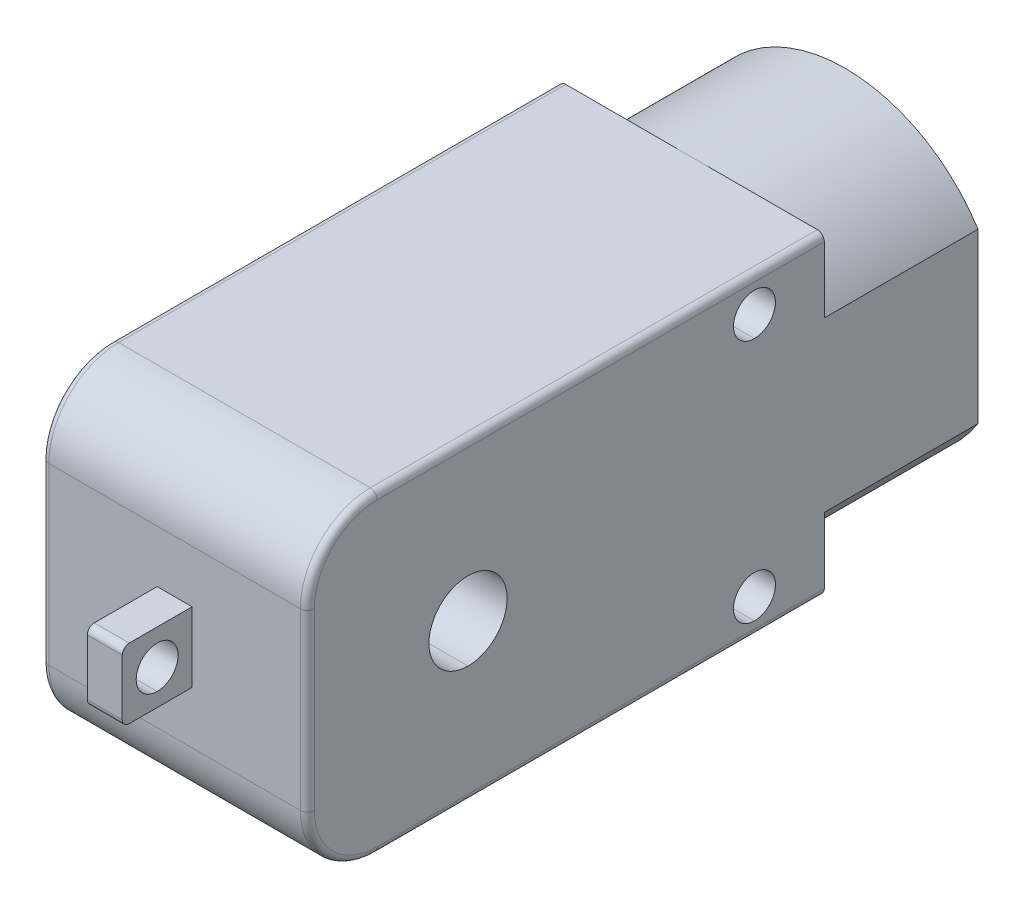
ISO-10303-21;
HEADER;
FILE_DESCRIPTION(('STEP AP214'),'2;1');
FILE_NAME('part.step','',(''),(''),'','','');
FILE_SCHEMA(('AUTOMOTIVE_DESIGN { 1 0 10303 214 1 1 1 1 }'));
ENDSEC;
DATA;
#1=APPLICATION_CONTEXT('core data for automotive mechanical design processes');
#2=APPLICATION_PROTOCOL_DEFINITION('international standard','automotive_design',2000,#1);
#3=PRODUCT_CONTEXT('',#1,'mechanical');
#4=PRODUCT('Part','Part','',(#3));
#5=PRODUCT_RELATED_PRODUCT_CATEGORY('part','',(#4));
#6=PRODUCT_DEFINITION_FORMATION('','',#4);
#7=PRODUCT_DEFINITION_CONTEXT('part definition',#1,'design');
#8=PRODUCT_DEFINITION('design','',#6,#7);
#9=PRODUCT_DEFINITION_SHAPE('','',#8);
#10=(LENGTH_UNIT() NAMED_UNIT(*) SI_UNIT(.MILLI.,.METRE.));
#11=(NAMED_UNIT(*) PLANE_ANGLE_UNIT() SI_UNIT($,.RADIAN.));
#12=(NAMED_UNIT(*) SI_UNIT($,.STERADIAN.) SOLID_ANGLE_UNIT());
#13=UNCERTAINTY_MEASURE_WITH_UNIT(LENGTH_MEASURE(1.E-05),#10,'distance_accuracy_value','');
#14=(GEOMETRIC_REPRESENTATION_CONTEXT(3) GLOBAL_UNCERTAINTY_ASSIGNED_CONTEXT((#13)) GLOBAL_UNIT_ASSIGNED_CONTEXT((#10,
#11,#12)) REPRESENTATION_CONTEXT('',''));
#15=CARTESIAN_POINT('',(0.,0.,0.));
#16=DIRECTION('',(0.,0.,1.));
#17=DIRECTION('',(1.,0.,0.));
#18=AXIS2_PLACEMENT_3D('',#15,#16,#17);
#19=CARTESIAN_POINT('',(0.,0.,2.));
#20=DIRECTION('',(0.,0.,-1.));
#21=DIRECTION('',(0.,-1.,0.));
#22=AXIS2_PLACEMENT_3D('',#19,#20,#21);
#23=PLANE('',#22);
#24=CARTESIAN_POINT('',(0.,0.,2.));
#25=DIRECTION('',(0.,0.,-1.));
#26=DIRECTION('',(-1.,0.,0.));
#27=AXIS2_PLACEMENT_3D('',#24,#25,#26);
#28=CIRCLE('',#27,3.);
#29=CARTESIAN_POINT('',(-3.,0.,2.));
#30=VERTEX_POINT('',#29);
#31=CARTESIAN_POINT('',(3.,0.,2.));
#32=VERTEX_POINT('',#31);
#33=EDGE_CURVE('E11',#30,#32,#28,.T.);
#34=ORIENTED_EDGE('',*,*,#33,.T.);
#35=CARTESIAN_POINT('',(0.,0.,2.));
#36=DIRECTION('',(0.,0.,-1.));
#37=DIRECTION('',(-1.,0.,0.));
#38=AXIS2_PLACEMENT_3D('',#35,#36,#37);
#39=CIRCLE('',#38,3.);
#40=EDGE_CURVE('E491',#32,#30,#39,.T.);
#41=ORIENTED_EDGE('',*,*,#40,.T.);
#42=EDGE_LOOP('',(#34,#41));
#43=FACE_BOUND('',#42,.T.);
#44=ADVANCED_FACE('F16',(#43),#23,.T.);
#45=CARTESIAN_POINT('',(0.,0.,2.));
#46=DIRECTION('',(0.,0.,-1.));
#47=DIRECTION('',(-1.,0.,0.));
#48=AXIS2_PLACEMENT_3D('',#45,#46,#47);
#49=CYLINDRICAL_SURFACE('',#48,3.);
#50=DIRECTION('',(0.,0.,-1.));
#51=VECTOR('',#50,1.);
#52=CARTESIAN_POINT('',(3.,0.,2.));
#53=LINE('',#52,#51);
#54=CARTESIAN_POINT('',(3.,0.,0.));
#55=VERTEX_POINT('',#54);
#56=EDGE_CURVE('E488',#32,#55,#53,.T.);
#57=ORIENTED_EDGE('',*,*,#56,.F.);
#58=ORIENTED_EDGE('',*,*,#33,.F.);
#59=DIRECTION('',(0.,0.,-1.));
#60=VECTOR('',#59,1.);
#61=CARTESIAN_POINT('',(-3.,0.,2.));
#62=LINE('',#61,#60);
#63=CARTESIAN_POINT('',(-3.,0.,0.));
#64=VERTEX_POINT('',#63);
#65=EDGE_CURVE('E455',#30,#64,#62,.T.);
#66=ORIENTED_EDGE('',*,*,#65,.T.);
#67=CARTESIAN_POINT('',(0.,0.,0.));
#68=DIRECTION('',(0.,0.,-1.));
#69=DIRECTION('',(-1.,0.,0.));
#70=AXIS2_PLACEMENT_3D('',#67,#68,#69);
#71=CIRCLE('',#70,3.);
#72=EDGE_CURVE('E27',#64,#55,#71,.T.);
#73=ORIENTED_EDGE('',*,*,#72,.T.);
#74=EDGE_LOOP('',(#57,#58,#66,#73));
#75=FACE_BOUND('',#74,.T.);
#76=ADVANCED_FACE('F801',(#75),#49,.F.);
#77=CARTESIAN_POINT('',(0.,0.,0.));
#78=DIRECTION('',(0.,0.,-1.));
#79=DIRECTION('',(0.,-1.,0.));
#80=AXIS2_PLACEMENT_3D('',#77,#78,#79);
#81=PLANE('',#80);
#82=ORIENTED_EDGE('',*,*,#72,.F.);
#83=CARTESIAN_POINT('',(0.,0.,0.));
#84=DIRECTION('',(0.,0.,-1.));
#85=DIRECTION('',(-1.,0.,0.));
#86=AXIS2_PLACEMENT_3D('',#83,#84,#85);
#87=CIRCLE('',#86,3.);
#88=EDGE_CURVE('E460',#55,#64,#87,.T.);
#89=ORIENTED_EDGE('',*,*,#88,.F.);
#90=EDGE_LOOP('',(#82,#89));
#91=FACE_BOUND('',#90,.T.);
#92=CARTESIAN_POINT('',(0.,0.,0.));
#93=DIRECTION('',(0.,0.,-1.));
#94=DIRECTION('',(-1.,0.,0.));
#95=AXIS2_PLACEMENT_3D('',#92,#93,#94);
#96=CIRCLE('',#95,10.05);
#97=CARTESIAN_POINT('',(-8.3,5.66678921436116,0.));
#98=VERTEX_POINT('',#97);
#99=CARTESIAN_POINT('',(8.3,5.66678921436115,0.));
#100=VERTEX_POINT('',#99);
#101=EDGE_CURVE('E454',#98,#100,#96,.T.);
#102=ORIENTED_EDGE('',*,*,#101,.T.);
#103=DIRECTION('',(0.,-1.,0.));
#104=VECTOR('',#103,1.);
#105=CARTESIAN_POINT('',(8.3,5.66678921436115,0.));
#106=LINE('',#105,#104);
#107=CARTESIAN_POINT('',(8.3,-5.66678921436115,0.));
#108=VERTEX_POINT('',#107);
#109=EDGE_CURVE('E42',#100,#108,#106,.T.);
#110=ORIENTED_EDGE('',*,*,#109,.T.);
#111=CARTESIAN_POINT('',(0.,0.,0.));
#112=DIRECTION('',(0.,0.,-1.));
#113=DIRECTION('',(-1.,0.,0.));
#114=AXIS2_PLACEMENT_3D('',#111,#112,#113);
#115=CIRCLE('',#114,10.05);
#116=CARTESIAN_POINT('',(-8.3,-5.66678921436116,0.));
#117=VERTEX_POINT('',#116);
#118=EDGE_CURVE('E348',#108,#117,#115,.T.);
#119=ORIENTED_EDGE('',*,*,#118,.T.);
#120=DIRECTION('',(0.,1.,0.));
#121=VECTOR('',#120,1.);
#122=CARTESIAN_POINT('',(-8.3,-5.66678921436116,0.));
#123=LINE('',#122,#121);
#124=EDGE_CURVE('E349',#117,#98,#123,.T.);
#125=ORIENTED_EDGE('',*,*,#124,.T.);
#126=EDGE_LOOP('',(#102,#110,#119,#125));
#127=FACE_BOUND('',#126,.T.);
#128=ADVANCED_FACE('F805',(#91,#127),#81,.T.);
#129=CARTESIAN_POINT('',(8.3,5.66678921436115,0.));
#130=DIRECTION('',(1.,0.,0.));
#131=DIRECTION('',(0.,1.,0.));
#132=AXIS2_PLACEMENT_3D('',#129,#130,#131);
#133=PLANE('',#132);
#134=DIRECTION('',(0.,-1.,0.));
#135=VECTOR('',#134,1.);
#136=CARTESIAN_POINT('',(8.3,5.66678921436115,-11.));
#137=LINE('',#136,#135);
#138=CARTESIAN_POINT('',(8.3,5.66678921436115,-11.));
#139=VERTEX_POINT('',#138);
#140=CARTESIAN_POINT('',(8.3,-5.66678921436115,-11.));
#141=VERTEX_POINT('',#140);
#142=EDGE_CURVE('E394',#139,#141,#137,.T.);
#143=ORIENTED_EDGE('',*,*,#142,.T.);
#144=DIRECTION('',(0.,0.,-1.));
#145=VECTOR('',#144,1.);
#146=CARTESIAN_POINT('',(8.3,-5.66678921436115,0.));
#147=LINE('',#146,#145);
#148=EDGE_CURVE('E402',#108,#141,#147,.T.);
#149=ORIENTED_EDGE('',*,*,#148,.F.);
#150=ORIENTED_EDGE('',*,*,#109,.F.);
#151=DIRECTION('',(0.,0.,-1.));
#152=VECTOR('',#151,1.);
#153=CARTESIAN_POINT('',(8.3,5.66678921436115,0.));
#154=LINE('',#153,#152);
#155=EDGE_CURVE('E668',#100,#139,#154,.T.);
#156=ORIENTED_EDGE('',*,*,#155,.T.);
#157=EDGE_LOOP('',(#143,#149,#150,#156));
#158=FACE_BOUND('',#157,.T.);
#159=ADVANCED_FACE('F890',(#158),#133,.F.);
#160=CARTESIAN_POINT('',(0.,0.,0.));
#161=DIRECTION('',(0.,0.,-1.));
#162=DIRECTION('',(-1.,0.,0.));
#163=AXIS2_PLACEMENT_3D('',#160,#161,#162);
#164=CYLINDRICAL_SURFACE('',#163,10.05);
#165=CARTESIAN_POINT('',(0.,0.,-11.));
#166=DIRECTION('',(0.,0.,-1.));
#167=DIRECTION('',(-1.,0.,0.));
#168=AXIS2_PLACEMENT_3D('',#165,#166,#167);
#169=CIRCLE('',#168,10.05);
#170=CARTESIAN_POINT('',(-8.3,-5.66678921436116,-11.));
#171=VERTEX_POINT('',#170);
#172=EDGE_CURVE('E399',#141,#171,#169,.T.);
#173=ORIENTED_EDGE('',*,*,#172,.T.);
#174=DIRECTION('',(0.,0.,-1.));
#175=VECTOR('',#174,1.);
#176=CARTESIAN_POINT('',(-8.3,-5.66678921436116,0.));
#177=LINE('',#176,#175);
#178=EDGE_CURVE('E346',#117,#171,#177,.T.);
#179=ORIENTED_EDGE('',*,*,#178,.F.);
#180=ORIENTED_EDGE('',*,*,#118,.F.);
#181=ORIENTED_EDGE('',*,*,#148,.T.);
#182=EDGE_LOOP('',(#173,#179,#180,#181));
#183=FACE_BOUND('',#182,.T.);
#184=ADVANCED_FACE('F893',(#183),#164,.F.);
#185=CARTESIAN_POINT('',(-8.3,-5.66678921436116,0.));
#186=DIRECTION('',(-1.,0.,0.));
#187=DIRECTION('',(0.,1.,0.));
#188=AXIS2_PLACEMENT_3D('',#185,#186,#187);
#189=PLANE('',#188);
#190=DIRECTION('',(0.,1.,0.));
#191=VECTOR('',#190,1.);
#192=CARTESIAN_POINT('',(-8.3,-5.66678921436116,-11.));
#193=LINE('',#192,#191);
#194=CARTESIAN_POINT('',(-8.3,5.66678921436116,-11.));
#195=VERTEX_POINT('',#194);
#196=EDGE_CURVE('E598',#171,#195,#193,.T.);
#197=ORIENTED_EDGE('',*,*,#196,.T.);
#198=DIRECTION('',(0.,0.,-1.));
#199=VECTOR('',#198,1.);
#200=CARTESIAN_POINT('',(-8.3,5.66678921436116,0.));
#201=LINE('',#200,#199);
#202=EDGE_CURVE('E451',#98,#195,#201,.T.);
#203=ORIENTED_EDGE('',*,*,#202,.F.);
#204=ORIENTED_EDGE('',*,*,#124,.F.);
#205=ORIENTED_EDGE('',*,*,#178,.T.);
#206=EDGE_LOOP('',(#197,#203,#204,#205));
#207=FACE_BOUND('',#206,.T.);
#208=ADVANCED_FACE('F914',(#207),#189,.F.);
#209=CARTESIAN_POINT('',(0.,0.,0.));
#210=DIRECTION('',(0.,0.,-1.));
#211=DIRECTION('',(-1.,0.,0.));
#212=AXIS2_PLACEMENT_3D('',#209,#210,#211);
#213=CYLINDRICAL_SURFACE('',#212,10.05);
#214=CARTESIAN_POINT('',(0.,0.,-11.));
#215=DIRECTION('',(0.,0.,-1.));
#216=DIRECTION('',(-1.,0.,0.));
#217=AXIS2_PLACEMENT_3D('',#214,#215,#216);
#218=CIRCLE('',#217,10.05);
#219=EDGE_CURVE('E602',#195,#139,#218,.T.);
#220=ORIENTED_EDGE('',*,*,#219,.T.);
#221=ORIENTED_EDGE('',*,*,#155,.F.);
#222=ORIENTED_EDGE('',*,*,#101,.F.);
#223=ORIENTED_EDGE('',*,*,#202,.T.);
#224=EDGE_LOOP('',(#220,#221,#222,#223));
#225=FACE_BOUND('',#224,.T.);
#226=ADVANCED_FACE('F911',(#225),#213,.F.);
#227=CARTESIAN_POINT('',(-9.5,0.,25.5));
#228=DIRECTION('',(1.,0.,0.));
#229=DIRECTION('',(0.,1.,0.));
#230=AXIS2_PLACEMENT_3D('',#227,#228,#229);
#231=CYLINDRICAL_SURFACE('',#230,2.8);
#232=DIRECTION('',(1.,0.,0.));
#233=VECTOR('',#232,1.);
#234=CARTESIAN_POINT('',(-9.5,-2.8,25.5));
#235=LINE('',#234,#233);
#236=CARTESIAN_POINT('',(-9.5,-2.8,25.5));
#237=VERTEX_POINT('',#236);
#238=CARTESIAN_POINT('',(9.5,-2.8,25.5));
#239=VERTEX_POINT('',#238);
#240=EDGE_CURVE('E654',#237,#239,#235,.T.);
#241=ORIENTED_EDGE('',*,*,#240,.F.);
#242=CARTESIAN_POINT('',(-9.5,0.,25.5));
#243=DIRECTION('',(1.,0.,0.));
#244=DIRECTION('',(0.,1.,0.));
#245=AXIS2_PLACEMENT_3D('',#242,#243,#244);
#246=CIRCLE('',#245,2.8);
#247=CARTESIAN_POINT('',(-9.5,2.8,25.5));
#248=VERTEX_POINT('',#247);
#249=EDGE_CURVE('E392',#248,#237,#246,.T.);
#250=ORIENTED_EDGE('',*,*,#249,.F.);
#251=DIRECTION('',(1.,0.,0.));
#252=VECTOR('',#251,1.);
#253=CARTESIAN_POINT('',(-9.5,2.8,25.5));
#254=LINE('',#253,#252);
#255=CARTESIAN_POINT('',(9.5,2.8,25.5));
#256=VERTEX_POINT('',#255);
#257=EDGE_CURVE('E382',#248,#256,#254,.T.);
#258=ORIENTED_EDGE('',*,*,#257,.T.);
#259=CARTESIAN_POINT('',(9.5,0.,25.5));
#260=DIRECTION('',(1.,0.,0.));
#261=DIRECTION('',(0.,1.,0.));
#262=AXIS2_PLACEMENT_3D('',#259,#260,#261);
#263=CIRCLE('',#262,2.8);
#264=EDGE_CURVE('E535',#256,#239,#263,.T.);
#265=ORIENTED_EDGE('',*,*,#264,.T.);
#266=EDGE_LOOP('',(#241,#250,#258,#265));
#267=FACE_BOUND('',#266,.T.);
#268=ADVANCED_FACE('F841',(#267),#231,.F.);
#269=CARTESIAN_POINT('',(-3.75,0.,39.5));
#270=DIRECTION('',(1.,0.,0.));
#271=DIRECTION('',(0.,1.,0.));
#272=AXIS2_PLACEMENT_3D('',#269,#270,#271);
#273=CYLINDRICAL_SURFACE('',#272,1.5);
#274=DIRECTION('',(1.,0.,0.));
#275=VECTOR('',#274,1.);
#276=CARTESIAN_POINT('',(-3.75,-1.5,39.5));
#277=LINE('',#276,#275);
#278=CARTESIAN_POINT('',(-1.25,-1.5,39.5));
#279=VERTEX_POINT('',#278);
#280=CARTESIAN_POINT('',(1.25,-1.5,39.5));
#281=VERTEX_POINT('',#280);
#282=EDGE_CURVE('E369',#279,#281,#277,.T.);
#283=ORIENTED_EDGE('',*,*,#282,.F.);
#284=CARTESIAN_POINT('',(-1.25,0.,39.5));
#285=DIRECTION('',(1.,0.,0.));
#286=DIRECTION('',(0.,1.,0.));
#287=AXIS2_PLACEMENT_3D('',#284,#285,#286);
#288=CIRCLE('',#287,1.5);
#289=CARTESIAN_POINT('',(-1.25,1.5,39.5));
#290=VERTEX_POINT('',#289);
#291=EDGE_CURVE('E533',#290,#279,#288,.T.);
#292=ORIENTED_EDGE('',*,*,#291,.F.);
#293=DIRECTION('',(1.,0.,0.));
#294=VECTOR('',#293,1.);
#295=CARTESIAN_POINT('',(-3.75,1.5,39.5));
#296=LINE('',#295,#294);
#297=CARTESIAN_POINT('',(1.25,1.5,39.5));
#298=VERTEX_POINT('',#297);
#299=EDGE_CURVE('E355',#290,#298,#296,.T.);
#300=ORIENTED_EDGE('',*,*,#299,.T.);
#301=CARTESIAN_POINT('',(1.25,0.,39.5));
#302=DIRECTION('',(1.,0.,0.));
#303=DIRECTION('',(0.,1.,0.));
#304=AXIS2_PLACEMENT_3D('',#301,#302,#303);
#305=CIRCLE('',#304,1.5);
#306=EDGE_CURVE('E443',#298,#281,#305,.T.);
#307=ORIENTED_EDGE('',*,*,#306,.T.);
#308=EDGE_LOOP('',(#283,#292,#300,#307));
#309=FACE_BOUND('',#308,.T.);
#310=ADVANCED_FACE('F823',(#309),#273,.F.);
#311=CARTESIAN_POINT('',(0.,2.,41.5));
#312=DIRECTION('',(-1.,0.,0.));
#313=DIRECTION('',(0.,0.,1.));
#314=AXIS2_PLACEMENT_3D('',#311,#312,#313);
#315=CYLINDRICAL_SURFACE('',#314,0.5);
#316=CARTESIAN_POINT('',(1.25,2.,41.5));
#317=DIRECTION('',(1.,0.,0.));
#318=DIRECTION('',(0.,-1.,0.));
#319=AXIS2_PLACEMENT_3D('',#316,#317,#318);
#320=CIRCLE('',#319,0.5);
#321=CARTESIAN_POINT('',(1.25,2.5,41.5));
#322=VERTEX_POINT('',#321);
#323=CARTESIAN_POINT('',(1.25,2.,42.));
#324=VERTEX_POINT('',#323);
#325=EDGE_CURVE('E422',#322,#324,#320,.T.);
#326=ORIENTED_EDGE('',*,*,#325,.F.);
#327=DIRECTION('',(1.,0.,0.));
#328=VECTOR('',#327,1.);
#329=CARTESIAN_POINT('',(1.25,2.5,41.5));
#330=LINE('',#329,#328);
#331=CARTESIAN_POINT('',(-1.25,2.5,41.5));
#332=VERTEX_POINT('',#331);
#333=EDGE_CURVE('E439',#332,#322,#330,.T.);
#334=ORIENTED_EDGE('',*,*,#333,.F.);
#335=CARTESIAN_POINT('',(-1.25,2.,41.5));
#336=DIRECTION('',(-1.,0.,0.));
#337=DIRECTION('',(0.,1.,0.));
#338=AXIS2_PLACEMENT_3D('',#335,#336,#337);
#339=CIRCLE('',#338,0.5);
#340=CARTESIAN_POINT('',(-1.25,2.,42.));
#341=VERTEX_POINT('',#340);
#342=EDGE_CURVE('E534',#341,#332,#339,.T.);
#343=ORIENTED_EDGE('',*,*,#342,.F.);
#344=DIRECTION('',(-1.,0.,0.));
#345=VECTOR('',#344,1.);
#346=CARTESIAN_POINT('',(0.,2.,42.));
#347=LINE('',#346,#345);
#348=EDGE_CURVE('E473',#324,#341,#347,.T.);
#349=ORIENTED_EDGE('',*,*,#348,.F.);
#350=EDGE_LOOP('',(#326,#334,#343,#349));
#351=FACE_BOUND('',#350,.T.);
#352=ADVANCED_FACE('F819',(#351),#315,.T.);
#353=CARTESIAN_POINT('',(0.,-2.,41.5));
#354=DIRECTION('',(1.,0.,0.));
#355=DIRECTION('',(0.,0.,-1.));
#356=AXIS2_PLACEMENT_3D('',#353,#354,#355);
#357=CYLINDRICAL_SURFACE('',#356,0.5);
#358=CARTESIAN_POINT('',(-1.25,-2.,41.5));
#359=DIRECTION('',(-1.,0.,0.));
#360=DIRECTION('',(0.,1.,0.));
#361=AXIS2_PLACEMENT_3D('',#358,#359,#360);
#362=CIRCLE('',#361,0.5);
#363=CARTESIAN_POINT('',(-1.25,-2.5,41.5));
#364=VERTEX_POINT('',#363);
#365=CARTESIAN_POINT('',(-1.25,-2.,42.));
#366=VERTEX_POINT('',#365);
#367=EDGE_CURVE('E608',#364,#366,#362,.T.);
#368=ORIENTED_EDGE('',*,*,#367,.F.);
#369=DIRECTION('',(-1.,0.,0.));
#370=VECTOR('',#369,1.);
#371=CARTESIAN_POINT('',(1.25,-2.5,41.5));
#372=LINE('',#371,#370);
#373=CARTESIAN_POINT('',(1.25,-2.5,41.5));
#374=VERTEX_POINT('',#373);
#375=EDGE_CURVE('E583',#374,#364,#372,.T.);
#376=ORIENTED_EDGE('',*,*,#375,.F.);
#377=CARTESIAN_POINT('',(1.25,-2.,41.5));
#378=DIRECTION('',(1.,0.,0.));
#379=DIRECTION('',(0.,-1.,0.));
#380=AXIS2_PLACEMENT_3D('',#377,#378,#379);
#381=CIRCLE('',#380,0.5);
#382=CARTESIAN_POINT('',(1.25,-2.,42.));
#383=VERTEX_POINT('',#382);
#384=EDGE_CURVE('E423',#383,#374,#381,.T.);
#385=ORIENTED_EDGE('',*,*,#384,.F.);
#386=DIRECTION('',(1.,0.,0.));
#387=VECTOR('',#386,1.);
#388=CARTESIAN_POINT('',(0.,-2.,42.));
#389=LINE('',#388,#387);
#390=EDGE_CURVE('E442',#366,#383,#389,.T.);
#391=ORIENTED_EDGE('',*,*,#390,.F.);
#392=EDGE_LOOP('',(#368,#376,#385,#391));
#393=FACE_BOUND('',#392,.T.);
#394=ADVANCED_FACE('F822',(#393),#357,.T.);
#395=CARTESIAN_POINT('',(9.,-10.75,37.));
#396=DIRECTION('',(0.,0.,-1.));
#397=DIRECTION('',(-1.,0.,0.));
#398=AXIS2_PLACEMENT_3D('',#395,#396,#397);
#399=CYLINDRICAL_SURFACE('',#398,0.5);
#400=CARTESIAN_POINT('',(9.,-10.75,32.));
#401=DIRECTION('',(0.,0.,-1.));
#402=DIRECTION('',(-1.,0.,0.));
#403=AXIS2_PLACEMENT_3D('',#400,#401,#402);
#404=CIRCLE('',#403,0.5);
#405=CARTESIAN_POINT('',(9.5,-10.75,32.));
#406=VERTEX_POINT('',#405);
#407=CARTESIAN_POINT('',(9.,-11.25,32.));
#408=VERTEX_POINT('',#407);
#409=EDGE_CURVE('E417',#406,#408,#404,.T.);
#410=ORIENTED_EDGE('',*,*,#409,.T.);
#411=DIRECTION('',(0.,0.,1.));
#412=VECTOR('',#411,1.);
#413=CARTESIAN_POINT('',(9.,-11.25,37.));
#414=LINE('',#413,#412);
#415=CARTESIAN_POINT('',(9.,-11.25,0.));
#416=VERTEX_POINT('',#415);
#417=EDGE_CURVE('E568',#416,#408,#414,.T.);
#418=ORIENTED_EDGE('',*,*,#417,.F.);
#419=CARTESIAN_POINT('',(9.,-10.75,0.));
#420=DIRECTION('',(0.,0.,-1.));
#421=DIRECTION('',(-1.,0.,0.));
#422=AXIS2_PLACEMENT_3D('',#419,#420,#421);
#423=CIRCLE('',#422,0.5);
#424=CARTESIAN_POINT('',(9.5,-10.75,0.));
#425=VERTEX_POINT('',#424);
#426=EDGE_CURVE('E412',#425,#416,#423,.T.);
#427=ORIENTED_EDGE('',*,*,#426,.F.);
#428=DIRECTION('',(0.,0.,-1.));
#429=VECTOR('',#428,1.);
#430=CARTESIAN_POINT('',(9.5,-10.75,37.));
#431=LINE('',#430,#429);
#432=EDGE_CURVE('E361',#406,#425,#431,.T.);
#433=ORIENTED_EDGE('',*,*,#432,.F.);
#434=EDGE_LOOP('',(#410,#418,#427,#433));
#435=FACE_BOUND('',#434,.T.);
#436=ADVANCED_FACE('F855',(#435),#399,.T.);
#437=CARTESIAN_POINT('',(9.,-6.25,32.));
#438=DIRECTION('',(-1.,0.,0.));
#439=DIRECTION('',(0.,-1.,0.));
#440=AXIS2_PLACEMENT_3D('',#437,#438,#439);
#441=TOROIDAL_SURFACE('',#440,4.5,0.5);
#442=CARTESIAN_POINT('',(9.,-6.25,36.5));
#443=DIRECTION('',(0.,-1.,0.));
#444=DIRECTION('',(0.,0.,-1.));
#445=AXIS2_PLACEMENT_3D('',#442,#443,#444);
#446=CIRCLE('',#445,0.5);
#447=CARTESIAN_POINT('',(9.5,-6.25,36.5));
#448=VERTEX_POINT('',#447);
#449=CARTESIAN_POINT('',(9.,-6.25,37.));
#450=VERTEX_POINT('',#449);
#451=EDGE_CURVE('E414',#448,#450,#446,.T.);
#452=ORIENTED_EDGE('',*,*,#451,.T.);
#453=CARTESIAN_POINT('',(9.,-6.25,32.));
#454=DIRECTION('',(-1.,0.,0.));
#455=DIRECTION('',(0.,-1.,0.));
#456=AXIS2_PLACEMENT_3D('',#453,#454,#455);
#457=CIRCLE('',#456,5.);
#458=EDGE_CURVE('E375',#408,#450,#457,.T.);
#459=ORIENTED_EDGE('',*,*,#458,.F.);
#460=ORIENTED_EDGE('',*,*,#409,.F.);
#461=CARTESIAN_POINT('',(9.5,-6.25,32.));
#462=DIRECTION('',(1.,0.,0.));
#463=DIRECTION('',(0.,-1.,0.));
#464=AXIS2_PLACEMENT_3D('',#461,#462,#463);
#465=CIRCLE('',#464,4.5);
#466=EDGE_CURVE('E365',#448,#406,#465,.T.);
#467=ORIENTED_EDGE('',*,*,#466,.F.);
#468=EDGE_LOOP('',(#452,#459,#460,#467));
#469=FACE_BOUND('',#468,.T.);
#470=ADVANCED_FACE('F829',(#469),#441,.T.);
#471=CARTESIAN_POINT('',(9.,0.,36.5));
#472=DIRECTION('',(0.,1.,0.));
#473=DIRECTION('',(-1.,0.,0.));
#474=AXIS2_PLACEMENT_3D('',#471,#472,#473);
#475=CYLINDRICAL_SURFACE('',#474,0.5);
#476=CARTESIAN_POINT('',(9.,6.25,36.5));
#477=DIRECTION('',(0.,-1.,0.));
#478=DIRECTION('',(0.,0.,-1.));
#479=AXIS2_PLACEMENT_3D('',#476,#477,#478);
#480=CIRCLE('',#479,0.5);
#481=CARTESIAN_POINT('',(9.5,6.25,36.5));
#482=VERTEX_POINT('',#481);
#483=CARTESIAN_POINT('',(9.,6.25,37.));
#484=VERTEX_POINT('',#483);
#485=EDGE_CURVE('E418',#482,#484,#480,.T.);
#486=ORIENTED_EDGE('',*,*,#485,.T.);
#487=DIRECTION('',(0.,1.,0.));
#488=VECTOR('',#487,1.);
#489=CARTESIAN_POINT('',(9.,0.,37.));
#490=LINE('',#489,#488);
#491=EDGE_CURVE('E438',#450,#484,#490,.T.);
#492=ORIENTED_EDGE('',*,*,#491,.F.);
#493=ORIENTED_EDGE('',*,*,#451,.F.);
#494=DIRECTION('',(0.,-1.,0.));
#495=VECTOR('',#494,1.);
#496=CARTESIAN_POINT('',(9.5,11.25,36.5));
#497=LINE('',#496,#495);
#498=EDGE_CURVE('E539',#482,#448,#497,.T.);
#499=ORIENTED_EDGE('',*,*,#498,.F.);
#500=EDGE_LOOP('',(#486,#492,#493,#499));
#501=FACE_BOUND('',#500,.T.);
#502=ADVANCED_FACE('F688',(#501),#475,.T.);
#503=CARTESIAN_POINT('',(9.,6.25,32.));
#504=DIRECTION('',(-1.,0.,0.));
#505=DIRECTION('',(0.,-1.,0.));
#506=AXIS2_PLACEMENT_3D('',#503,#504,#505);
#507=TOROIDAL_SURFACE('',#506,4.5,0.5);
#508=CARTESIAN_POINT('',(9.,10.75,32.));
#509=DIRECTION('',(0.,0.,1.));
#510=DIRECTION('',(1.,0.,0.));
#511=AXIS2_PLACEMENT_3D('',#508,#509,#510);
#512=CIRCLE('',#511,0.5);
#513=CARTESIAN_POINT('',(9.5,10.75,32.));
#514=VERTEX_POINT('',#513);
#515=CARTESIAN_POINT('',(9.,11.25,32.));
#516=VERTEX_POINT('',#515);
#517=EDGE_CURVE('E427',#514,#516,#512,.T.);
#518=ORIENTED_EDGE('',*,*,#517,.T.);
#519=CARTESIAN_POINT('',(9.,6.25,32.));
#520=DIRECTION('',(-1.,0.,0.));
#521=DIRECTION('',(0.,-1.,0.));
#522=AXIS2_PLACEMENT_3D('',#519,#520,#521);
#523=CIRCLE('',#522,5.);
#524=EDGE_CURVE('E374',#484,#516,#523,.T.);
#525=ORIENTED_EDGE('',*,*,#524,.F.);
#526=ORIENTED_EDGE('',*,*,#485,.F.);
#527=CARTESIAN_POINT('',(9.5,6.25,32.));
#528=DIRECTION('',(1.,0.,0.));
#529=DIRECTION('',(0.,-1.,0.));
#530=AXIS2_PLACEMENT_3D('',#527,#528,#529);
#531=CIRCLE('',#530,4.5);
#532=EDGE_CURVE('E545',#514,#482,#531,.T.);
#533=ORIENTED_EDGE('',*,*,#532,.F.);
#534=EDGE_LOOP('',(#518,#525,#526,#533));
#535=FACE_BOUND('',#534,.T.);
#536=ADVANCED_FACE('F691',(#535),#507,.T.);
#537=CARTESIAN_POINT('',(9.,10.75,37.));
#538=DIRECTION('',(0.,0.,-1.));
#539=DIRECTION('',(-1.,0.,0.));
#540=AXIS2_PLACEMENT_3D('',#537,#538,#539);
#541=CYLINDRICAL_SURFACE('',#540,0.5);
#542=CARTESIAN_POINT('',(9.,10.75,0.));
#543=DIRECTION('',(0.,0.,-1.));
#544=DIRECTION('',(-1.,0.,0.));
#545=AXIS2_PLACEMENT_3D('',#542,#543,#544);
#546=CIRCLE('',#545,0.5);
#547=CARTESIAN_POINT('',(9.,11.25,0.));
#548=VERTEX_POINT('',#547);
#549=CARTESIAN_POINT('',(9.5,10.75,0.));
#550=VERTEX_POINT('',#549);
#551=EDGE_CURVE('E623',#548,#550,#546,.T.);
#552=ORIENTED_EDGE('',*,*,#551,.F.);
#553=DIRECTION('',(0.,0.,-1.));
#554=VECTOR('',#553,1.);
#555=CARTESIAN_POINT('',(9.,11.25,37.));
#556=LINE('',#555,#554);
#557=EDGE_CURVE('E381',#516,#548,#556,.T.);
#558=ORIENTED_EDGE('',*,*,#557,.F.);
#559=ORIENTED_EDGE('',*,*,#517,.F.);
#560=DIRECTION('',(0.,0.,1.));
#561=VECTOR('',#560,1.);
#562=CARTESIAN_POINT('',(9.5,10.75,37.));
#563=LINE('',#562,#561);
#564=EDGE_CURVE('E554',#550,#514,#563,.T.);
#565=ORIENTED_EDGE('',*,*,#564,.F.);
#566=EDGE_LOOP('',(#552,#558,#559,#565));
#567=FACE_BOUND('',#566,.T.);
#568=ADVANCED_FACE('F699',(#567),#541,.T.);
#569=CARTESIAN_POINT('',(-9.,-10.75,37.));
#570=DIRECTION('',(0.,0.,-1.));
#571=DIRECTION('',(-1.,0.,0.));
#572=AXIS2_PLACEMENT_3D('',#569,#570,#571);
#573=CYLINDRICAL_SURFACE('',#572,0.5);
#574=CARTESIAN_POINT('',(-9.,-10.75,32.));
#575=DIRECTION('',(0.,0.,-1.));
#576=DIRECTION('',(-1.,0.,0.));
#577=AXIS2_PLACEMENT_3D('',#574,#575,#576);
#578=CIRCLE('',#577,0.5);
#579=CARTESIAN_POINT('',(-9.,-11.25,32.));
#580=VERTEX_POINT('',#579);
#581=CARTESIAN_POINT('',(-9.5,-10.75,32.));
#582=VERTEX_POINT('',#581);
#583=EDGE_CURVE('E430',#580,#582,#578,.T.);
#584=ORIENTED_EDGE('',*,*,#583,.T.);
#585=DIRECTION('',(0.,0.,1.));
#586=VECTOR('',#585,1.);
#587=CARTESIAN_POINT('',(-9.5,-10.75,37.));
#588=LINE('',#587,#586);
#589=CARTESIAN_POINT('',(-9.5,-10.75,0.));
#590=VERTEX_POINT('',#589);
#591=EDGE_CURVE('E482',#590,#582,#588,.T.);
#592=ORIENTED_EDGE('',*,*,#591,.F.);
#593=CARTESIAN_POINT('',(-9.,-10.75,0.));
#594=DIRECTION('',(0.,0.,-1.));
#595=DIRECTION('',(-1.,0.,0.));
#596=AXIS2_PLACEMENT_3D('',#593,#594,#595);
#597=CIRCLE('',#596,0.5);
#598=CARTESIAN_POINT('',(-9.,-11.25,0.));
#599=VERTEX_POINT('',#598);
#600=EDGE_CURVE('E376',#599,#590,#597,.T.);
#601=ORIENTED_EDGE('',*,*,#600,.F.);
#602=DIRECTION('',(0.,0.,-1.));
#603=VECTOR('',#602,1.);
#604=CARTESIAN_POINT('',(-9.,-11.25,37.));
#605=LINE('',#604,#603);
#606=EDGE_CURVE('E493',#580,#599,#605,.T.);
#607=ORIENTED_EDGE('',*,*,#606,.F.);
#608=EDGE_LOOP('',(#584,#592,#601,#607));
#609=FACE_BOUND('',#608,.T.);
#610=ADVANCED_FACE('F867',(#609),#573,.T.);
#611=CARTESIAN_POINT('',(-9.,-6.25,32.));
#612=DIRECTION('',(1.,0.,0.));
#613=DIRECTION('',(0.,1.,0.));
#614=AXIS2_PLACEMENT_3D('',#611,#612,#613);
#615=TOROIDAL_SURFACE('',#614,4.5,0.5);
#616=CARTESIAN_POINT('',(-9.,-6.25,36.5));
#617=DIRECTION('',(0.,-1.,0.));
#618=DIRECTION('',(0.,0.,-1.));
#619=AXIS2_PLACEMENT_3D('',#616,#617,#618);
#620=CIRCLE('',#619,0.5);
#621=CARTESIAN_POINT('',(-9.,-6.25,37.));
#622=VERTEX_POINT('',#621);
#623=CARTESIAN_POINT('',(-9.5,-6.25,36.5));
#624=VERTEX_POINT('',#623);
#625=EDGE_CURVE('E633',#622,#624,#620,.T.);
#626=ORIENTED_EDGE('',*,*,#625,.T.);
#627=CARTESIAN_POINT('',(-9.5,-6.25,32.));
#628=DIRECTION('',(-1.,0.,0.));
#629=DIRECTION('',(0.,1.,0.));
#630=AXIS2_PLACEMENT_3D('',#627,#628,#629);
#631=CIRCLE('',#630,4.5);
#632=EDGE_CURVE('E486',#582,#624,#631,.T.);
#633=ORIENTED_EDGE('',*,*,#632,.F.);
#634=ORIENTED_EDGE('',*,*,#583,.F.);
#635=CARTESIAN_POINT('',(-9.,-6.25,32.));
#636=DIRECTION('',(1.,0.,0.));
#637=DIRECTION('',(0.,1.,0.));
#638=AXIS2_PLACEMENT_3D('',#635,#636,#637);
#639=CIRCLE('',#638,5.);
#640=EDGE_CURVE('E398',#622,#580,#639,.T.);
#641=ORIENTED_EDGE('',*,*,#640,.F.);
#642=EDGE_LOOP('',(#626,#633,#634,#641));
#643=FACE_BOUND('',#642,.T.);
#644=ADVANCED_FACE('F754',(#643),#615,.T.);
#645=CARTESIAN_POINT('',(-9.,0.,36.5));
#646=DIRECTION('',(0.,-1.,0.));
#647=DIRECTION('',(1.,0.,0.));
#648=AXIS2_PLACEMENT_3D('',#645,#646,#647);
#649=CYLINDRICAL_SURFACE('',#648,0.5);
#650=CARTESIAN_POINT('',(-9.,6.25,36.5));
#651=DIRECTION('',(0.,-1.,0.));
#652=DIRECTION('',(0.,0.,-1.));
#653=AXIS2_PLACEMENT_3D('',#650,#651,#652);
#654=CIRCLE('',#653,0.5);
#655=CARTESIAN_POINT('',(-9.,6.25,37.));
#656=VERTEX_POINT('',#655);
#657=CARTESIAN_POINT('',(-9.5,6.25,36.5));
#658=VERTEX_POINT('',#657);
#659=EDGE_CURVE('E572',#656,#658,#654,.T.);
#660=ORIENTED_EDGE('',*,*,#659,.T.);
#661=DIRECTION('',(0.,1.,0.));
#662=VECTOR('',#661,1.);
#663=CARTESIAN_POINT('',(-9.5,11.25,36.5));
#664=LINE('',#663,#662);
#665=EDGE_CURVE('E649',#624,#658,#664,.T.);
#666=ORIENTED_EDGE('',*,*,#665,.F.);
#667=ORIENTED_EDGE('',*,*,#625,.F.);
#668=DIRECTION('',(0.,-1.,0.));
#669=VECTOR('',#668,1.);
#670=CARTESIAN_POINT('',(-9.,0.,37.));
#671=LINE('',#670,#669);
#672=EDGE_CURVE('E542',#656,#622,#671,.T.);
#673=ORIENTED_EDGE('',*,*,#672,.F.);
#674=EDGE_LOOP('',(#660,#666,#667,#673));
#675=FACE_BOUND('',#674,.T.);
#676=ADVANCED_FACE('F746',(#675),#649,.T.);
#677=CARTESIAN_POINT('',(-9.,6.25,32.));
#678=DIRECTION('',(1.,0.,0.));
#679=DIRECTION('',(0.,1.,0.));
#680=AXIS2_PLACEMENT_3D('',#677,#678,#679);
#681=TOROIDAL_SURFACE('',#680,4.5,0.5);
#682=CARTESIAN_POINT('',(-9.,10.75,32.));
#683=DIRECTION('',(0.,0.,1.));
#684=DIRECTION('',(1.,0.,0.));
#685=AXIS2_PLACEMENT_3D('',#682,#683,#684);
#686=CIRCLE('',#685,0.5);
#687=CARTESIAN_POINT('',(-9.,11.25,32.));
#688=VERTEX_POINT('',#687);
#689=CARTESIAN_POINT('',(-9.5,10.75,32.));
#690=VERTEX_POINT('',#689);
#691=EDGE_CURVE('E304',#688,#690,#686,.T.);
#692=ORIENTED_EDGE('',*,*,#691,.T.);
#693=CARTESIAN_POINT('',(-9.5,6.25,32.));
#694=DIRECTION('',(-1.,0.,0.));
#695=DIRECTION('',(0.,1.,0.));
#696=AXIS2_PLACEMENT_3D('',#693,#694,#695);
#697=CIRCLE('',#696,4.5);
#698=EDGE_CURVE('E652',#658,#690,#697,.T.);
#699=ORIENTED_EDGE('',*,*,#698,.F.);
#700=ORIENTED_EDGE('',*,*,#659,.F.);
#701=CARTESIAN_POINT('',(-9.,6.25,32.));
#702=DIRECTION('',(1.,0.,0.));
#703=DIRECTION('',(0.,1.,0.));
#704=AXIS2_PLACEMENT_3D('',#701,#702,#703);
#705=CIRCLE('',#704,5.);
#706=EDGE_CURVE('E370',#688,#656,#705,.T.);
#707=ORIENTED_EDGE('',*,*,#706,.F.);
#708=EDGE_LOOP('',(#692,#699,#700,#707));
#709=FACE_BOUND('',#708,.T.);
#710=ADVANCED_FACE('F748',(#709),#681,.T.);
#711=CARTESIAN_POINT('',(-9.,10.75,37.));
#712=DIRECTION('',(0.,0.,-1.));
#713=DIRECTION('',(-1.,0.,0.));
#714=AXIS2_PLACEMENT_3D('',#711,#712,#713);
#715=CYLINDRICAL_SURFACE('',#714,0.5);
#716=CARTESIAN_POINT('',(-9.,10.75,0.));
#717=DIRECTION('',(0.,0.,-1.));
#718=DIRECTION('',(-1.,0.,0.));
#719=AXIS2_PLACEMENT_3D('',#716,#717,#718);
#720=CIRCLE('',#719,0.5);
#721=CARTESIAN_POINT('',(-9.5,10.75,0.));
#722=VERTEX_POINT('',#721);
#723=CARTESIAN_POINT('',(-9.,11.25,0.));
#724=VERTEX_POINT('',#723);
#725=EDGE_CURVE('E20',#722,#724,#720,.T.);
#726=ORIENTED_EDGE('',*,*,#725,.F.);
#727=DIRECTION('',(0.,0.,-1.));
#728=VECTOR('',#727,1.);
#729=CARTESIAN_POINT('',(-9.5,10.75,37.));
#730=LINE('',#729,#728);
#731=EDGE_CURVE('E528',#690,#722,#730,.T.);
#732=ORIENTED_EDGE('',*,*,#731,.F.);
#733=ORIENTED_EDGE('',*,*,#691,.F.);
#734=DIRECTION('',(0.,0.,1.));
#735=VECTOR('',#734,1.);
#736=CARTESIAN_POINT('',(-9.,11.25,37.));
#737=LINE('',#736,#735);
#738=EDGE_CURVE('E298',#724,#688,#737,.T.);
#739=ORIENTED_EDGE('',*,*,#738,.F.);
#740=EDGE_LOOP('',(#726,#732,#733,#739));
#741=FACE_BOUND('',#740,.T.);
#742=ADVANCED_FACE('F300',(#741),#715,.T.);
#743=CARTESIAN_POINT('',(0.,0.,42.));
#744=DIRECTION('',(0.,0.,-1.));
#745=DIRECTION('',(0.,-1.,0.));
#746=AXIS2_PLACEMENT_3D('',#743,#744,#745);
#747=PLANE('',#746);
#748=DIRECTION('',(0.,-1.,0.));
#749=VECTOR('',#748,1.);
#750=CARTESIAN_POINT('',(-1.25,2.5,42.));
#751=LINE('',#750,#749);
#752=EDGE_CURVE('E612',#341,#366,#751,.T.);
#753=ORIENTED_EDGE('',*,*,#752,.T.);
#754=ORIENTED_EDGE('',*,*,#390,.T.);
#755=DIRECTION('',(0.,1.,0.));
#756=VECTOR('',#755,1.);
#757=CARTESIAN_POINT('',(1.25,2.5,42.));
#758=LINE('',#757,#756);
#759=EDGE_CURVE('E580',#383,#324,#758,.T.);
#760=ORIENTED_EDGE('',*,*,#759,.T.);
#761=ORIENTED_EDGE('',*,*,#348,.T.);
#762=EDGE_LOOP('',(#753,#754,#760,#761));
#763=FACE_BOUND('',#762,.T.);
#764=ADVANCED_FACE('F849',(#763),#747,.F.);
#765=CARTESIAN_POINT('',(1.25,2.5,42.));
#766=DIRECTION('',(0.,-1.,0.));
#767=DIRECTION('',(0.,0.,-1.));
#768=AXIS2_PLACEMENT_3D('',#765,#766,#767);
#769=PLANE('',#768);
#770=DIRECTION('',(0.,0.,-1.));
#771=VECTOR('',#770,1.);
#772=CARTESIAN_POINT('',(-1.25,2.5,42.));
#773=LINE('',#772,#771);
#774=CARTESIAN_POINT('',(-1.25,2.5,37.));
#775=VERTEX_POINT('',#774);
#776=EDGE_CURVE('E530',#332,#775,#773,.T.);
#777=ORIENTED_EDGE('',*,*,#776,.F.);
#778=ORIENTED_EDGE('',*,*,#333,.T.);
#779=DIRECTION('',(0.,0.,-1.));
#780=VECTOR('',#779,1.);
#781=CARTESIAN_POINT('',(1.25,2.5,42.));
#782=LINE('',#781,#780);
#783=CARTESIAN_POINT('',(1.25,2.5,37.));
#784=VERTEX_POINT('',#783);
#785=EDGE_CURVE('E419',#322,#784,#782,.T.);
#786=ORIENTED_EDGE('',*,*,#785,.T.);
#787=DIRECTION('',(-1.,0.,0.));
#788=VECTOR('',#787,1.);
#789=CARTESIAN_POINT('',(1.25,2.5,37.));
#790=LINE('',#789,#788);
#791=EDGE_CURVE('E350',#784,#775,#790,.T.);
#792=ORIENTED_EDGE('',*,*,#791,.T.);
#793=EDGE_LOOP('',(#777,#778,#786,#792));
#794=FACE_BOUND('',#793,.T.);
#795=ADVANCED_FACE('F845',(#794),#769,.F.);
#796=CARTESIAN_POINT('',(1.25,2.5,42.));
#797=DIRECTION('',(-1.,0.,0.));
#798=DIRECTION('',(0.,1.,0.));
#799=AXIS2_PLACEMENT_3D('',#796,#797,#798);
#800=PLANE('',#799);
#801=ORIENTED_EDGE('',*,*,#306,.F.);
#802=CARTESIAN_POINT('',(1.25,0.,39.5));
#803=DIRECTION('',(1.,0.,0.));
#804=DIRECTION('',(0.,1.,0.));
#805=AXIS2_PLACEMENT_3D('',#802,#803,#804);
#806=CIRCLE('',#805,1.5);
#807=EDGE_CURVE('E360',#281,#298,#806,.T.);
#808=ORIENTED_EDGE('',*,*,#807,.F.);
#809=EDGE_LOOP('',(#801,#808));
#810=FACE_BOUND('',#809,.T.);
#811=ORIENTED_EDGE('',*,*,#759,.F.);
#812=ORIENTED_EDGE('',*,*,#384,.T.);
#813=DIRECTION('',(0.,0.,-1.));
#814=VECTOR('',#813,1.);
#815=CARTESIAN_POINT('',(1.25,-2.5,42.));
#816=LINE('',#815,#814);
#817=CARTESIAN_POINT('',(1.25,-2.5,37.));
#818=VERTEX_POINT('',#817);
#819=EDGE_CURVE('E587',#374,#818,#816,.T.);
#820=ORIENTED_EDGE('',*,*,#819,.T.);
#821=DIRECTION('',(0.,1.,0.));
#822=VECTOR('',#821,1.);
#823=CARTESIAN_POINT('',(1.25,2.5,37.));
#824=LINE('',#823,#822);
#825=EDGE_CURVE('E342',#818,#784,#824,.T.);
#826=ORIENTED_EDGE('',*,*,#825,.T.);
#827=ORIENTED_EDGE('',*,*,#785,.F.);
#828=ORIENTED_EDGE('',*,*,#325,.T.);
#829=EDGE_LOOP('',(#811,#812,#820,#826,#827,#828));
#830=FACE_BOUND('',#829,.T.);
#831=ADVANCED_FACE('F848',(#810,#830),#800,.F.);
#832=CARTESIAN_POINT('',(1.25,-2.5,42.));
#833=DIRECTION('',(0.,1.,0.));
#834=DIRECTION('',(1.,0.,0.));
#835=AXIS2_PLACEMENT_3D('',#832,#833,#834);
#836=PLANE('',#835);
#837=ORIENTED_EDGE('',*,*,#819,.F.);
#838=ORIENTED_EDGE('',*,*,#375,.T.);
#839=DIRECTION('',(0.,0.,-1.));
#840=VECTOR('',#839,1.);
#841=CARTESIAN_POINT('',(-1.25,-2.5,42.));
#842=LINE('',#841,#840);
#843=CARTESIAN_POINT('',(-1.25,-2.5,37.));
#844=VERTEX_POINT('',#843);
#845=EDGE_CURVE('E434',#364,#844,#842,.T.);
#846=ORIENTED_EDGE('',*,*,#845,.T.);
#847=DIRECTION('',(1.,0.,0.));
#848=VECTOR('',#847,1.);
#849=CARTESIAN_POINT('',(1.25,-2.5,37.));
#850=LINE('',#849,#848);
#851=EDGE_CURVE('E333',#844,#818,#850,.T.);
#852=ORIENTED_EDGE('',*,*,#851,.T.);
#853=EDGE_LOOP('',(#837,#838,#846,#852));
#854=FACE_BOUND('',#853,.T.);
#855=ADVANCED_FACE('F885',(#854),#836,.F.);
#856=CARTESIAN_POINT('',(-1.25,2.5,42.));
#857=DIRECTION('',(1.,0.,0.));
#858=DIRECTION('',(0.,1.,0.));
#859=AXIS2_PLACEMENT_3D('',#856,#857,#858);
#860=PLANE('',#859);
#861=ORIENTED_EDGE('',*,*,#291,.T.);
#862=CARTESIAN_POINT('',(-1.25,0.,39.5));
#863=DIRECTION('',(1.,0.,0.));
#864=DIRECTION('',(0.,1.,0.));
#865=AXIS2_PLACEMENT_3D('',#862,#863,#864);
#866=CIRCLE('',#865,1.5);
#867=EDGE_CURVE('E386',#279,#290,#866,.T.);
#868=ORIENTED_EDGE('',*,*,#867,.T.);
#869=EDGE_LOOP('',(#861,#868));
#870=FACE_BOUND('',#869,.T.);
#871=ORIENTED_EDGE('',*,*,#845,.F.);
#872=ORIENTED_EDGE('',*,*,#367,.T.);
#873=ORIENTED_EDGE('',*,*,#752,.F.);
#874=ORIENTED_EDGE('',*,*,#342,.T.);
#875=ORIENTED_EDGE('',*,*,#776,.T.);
#876=DIRECTION('',(0.,-1.,0.));
#877=VECTOR('',#876,1.);
#878=CARTESIAN_POINT('',(-1.25,2.5,37.));
#879=LINE('',#878,#877);
#880=EDGE_CURVE('E354',#775,#844,#879,.T.);
#881=ORIENTED_EDGE('',*,*,#880,.T.);
#882=EDGE_LOOP('',(#871,#872,#873,#874,#875,#881));
#883=FACE_BOUND('',#882,.T.);
#884=ADVANCED_FACE('F888',(#870,#883),#860,.F.);
#885=CARTESIAN_POINT('',(-9.5,8.75,5.));
#886=DIRECTION('',(1.,0.,0.));
#887=DIRECTION('',(0.,1.,0.));
#888=AXIS2_PLACEMENT_3D('',#885,#886,#887);
#889=CYLINDRICAL_SURFACE('',#888,1.5);
#890=DIRECTION('',(1.,0.,0.));
#891=VECTOR('',#890,1.);
#892=CARTESIAN_POINT('',(-9.5,7.25,5.));
#893=LINE('',#892,#891);
#894=CARTESIAN_POINT('',(-9.5,7.25,5.));
#895=VERTEX_POINT('',#894);
#896=CARTESIAN_POINT('',(9.5,7.25,5.));
#897=VERTEX_POINT('',#896);
#898=EDGE_CURVE('E481',#895,#897,#893,.T.);
#899=ORIENTED_EDGE('',*,*,#898,.F.);
#900=CARTESIAN_POINT('',(-9.5,8.75,5.));
#901=DIRECTION('',(1.,0.,0.));
#902=DIRECTION('',(0.,1.,0.));
#903=AXIS2_PLACEMENT_3D('',#900,#901,#902);
#904=CIRCLE('',#903,1.5);
#905=CARTESIAN_POINT('',(-9.5,10.25,5.));
#906=VERTEX_POINT('',#905);
#907=EDGE_CURVE('E466',#906,#895,#904,.T.);
#908=ORIENTED_EDGE('',*,*,#907,.F.);
#909=DIRECTION('',(1.,0.,0.));
#910=VECTOR('',#909,1.);
#911=CARTESIAN_POINT('',(-9.5,10.25,5.));
#912=LINE('',#911,#910);
#913=CARTESIAN_POINT('',(9.5,10.25,5.));
#914=VERTEX_POINT('',#913);
#915=EDGE_CURVE('E480',#906,#914,#912,.T.);
#916=ORIENTED_EDGE('',*,*,#915,.T.);
#917=CARTESIAN_POINT('',(9.5,8.75,5.));
#918=DIRECTION('',(1.,0.,0.));
#919=DIRECTION('',(0.,1.,0.));
#920=AXIS2_PLACEMENT_3D('',#917,#918,#919);
#921=CIRCLE('',#920,1.5);
#922=EDGE_CURVE('E538',#914,#897,#921,.T.);
#923=ORIENTED_EDGE('',*,*,#922,.T.);
#924=EDGE_LOOP('',(#899,#908,#916,#923));
#925=FACE_BOUND('',#924,.T.);
#926=ADVANCED_FACE('F909',(#925),#889,.F.);
#927=CARTESIAN_POINT('',(-9.5,-8.75,5.));
#928=DIRECTION('',(1.,0.,0.));
#929=DIRECTION('',(0.,1.,0.));
#930=AXIS2_PLACEMENT_3D('',#927,#928,#929);
#931=CYLINDRICAL_SURFACE('',#930,1.5);
#932=DIRECTION('',(1.,0.,0.));
#933=VECTOR('',#932,1.);
#934=CARTESIAN_POINT('',(-9.5,-10.25,5.));
#935=LINE('',#934,#933);
#936=CARTESIAN_POINT('',(-9.5,-10.25,5.));
#937=VERTEX_POINT('',#936);
#938=CARTESIAN_POINT('',(9.5,-10.25,5.));
#939=VERTEX_POINT('',#938);
#940=EDGE_CURVE('E588',#937,#939,#935,.T.);
#941=ORIENTED_EDGE('',*,*,#940,.F.);
#942=CARTESIAN_POINT('',(-9.5,-8.75,5.));
#943=DIRECTION('',(1.,0.,0.));
#944=DIRECTION('',(0.,1.,0.));
#945=AXIS2_PLACEMENT_3D('',#942,#943,#944);
#946=CIRCLE('',#945,1.5);
#947=CARTESIAN_POINT('',(-9.5,-7.25,5.));
#948=VERTEX_POINT('',#947);
#949=EDGE_CURVE('E461',#948,#937,#946,.T.);
#950=ORIENTED_EDGE('',*,*,#949,.F.);
#951=DIRECTION('',(1.,0.,0.));
#952=VECTOR('',#951,1.);
#953=CARTESIAN_POINT('',(-9.5,-7.25,5.));
#954=LINE('',#953,#952);
#955=CARTESIAN_POINT('',(9.5,-7.25,5.));
#956=VERTEX_POINT('',#955);
#957=EDGE_CURVE('E467',#948,#956,#954,.T.);
#958=ORIENTED_EDGE('',*,*,#957,.T.);
#959=CARTESIAN_POINT('',(9.5,-8.75,5.));
#960=DIRECTION('',(1.,0.,0.));
#961=DIRECTION('',(0.,1.,0.));
#962=AXIS2_PLACEMENT_3D('',#959,#960,#961);
#963=CIRCLE('',#962,1.5);
#964=EDGE_CURVE('E310',#956,#939,#963,.T.);
#965=ORIENTED_EDGE('',*,*,#964,.T.);
#966=EDGE_LOOP('',(#941,#950,#958,#965));
#967=FACE_BOUND('',#966,.T.);
#968=ADVANCED_FACE('F906',(#967),#931,.F.);
#969=CARTESIAN_POINT('',(0.,6.25,32.));
#970=DIRECTION('',(-1.,0.,0.));
#971=DIRECTION('',(0.,0.,1.));
#972=AXIS2_PLACEMENT_3D('',#969,#970,#971);
#973=CYLINDRICAL_SURFACE('',#972,5.);
#974=DIRECTION('',(1.,0.,0.));
#975=VECTOR('',#974,1.);
#976=CARTESIAN_POINT('',(9.5,11.25,32.));
#977=LINE('',#976,#975);
#978=EDGE_CURVE('E309',#688,#516,#977,.T.);
#979=ORIENTED_EDGE('',*,*,#978,.F.);
#980=ORIENTED_EDGE('',*,*,#706,.T.);
#981=DIRECTION('',(-1.,0.,0.));
#982=VECTOR('',#981,1.);
#983=CARTESIAN_POINT('',(0.,6.25,37.));
#984=LINE('',#983,#982);
#985=EDGE_CURVE('E471',#484,#656,#984,.T.);
#986=ORIENTED_EDGE('',*,*,#985,.F.);
#987=ORIENTED_EDGE('',*,*,#524,.T.);
#988=EDGE_LOOP('',(#979,#980,#986,#987));
#989=FACE_BOUND('',#988,.T.);
#990=ADVANCED_FACE('F696',(#989),#973,.T.);
#991=CARTESIAN_POINT('',(0.,-6.25,32.));
#992=DIRECTION('',(1.,0.,0.));
#993=DIRECTION('',(0.,1.,0.));
#994=AXIS2_PLACEMENT_3D('',#991,#992,#993);
#995=CYLINDRICAL_SURFACE('',#994,5.);
#996=DIRECTION('',(1.,0.,0.));
#997=VECTOR('',#996,1.);
#998=CARTESIAN_POINT('',(0.,-6.25,37.));
#999=LINE('',#998,#997);
#1000=EDGE_CURVE('E642',#622,#450,#999,.T.);
#1001=ORIENTED_EDGE('',*,*,#1000,.F.);
#1002=ORIENTED_EDGE('',*,*,#640,.T.);
#1003=DIRECTION('',(-1.,0.,0.));
#1004=VECTOR('',#1003,1.);
#1005=CARTESIAN_POINT('',(9.5,-11.25,32.));
#1006=LINE('',#1005,#1004);
#1007=EDGE_CURVE('E465',#408,#580,#1006,.T.);
#1008=ORIENTED_EDGE('',*,*,#1007,.F.);
#1009=ORIENTED_EDGE('',*,*,#458,.T.);
#1010=EDGE_LOOP('',(#1001,#1002,#1008,#1009));
#1011=FACE_BOUND('',#1010,.T.);
#1012=ADVANCED_FACE('F680',(#1011),#995,.T.);
#1013=CARTESIAN_POINT('',(0.,0.,-11.));
#1014=DIRECTION('',(0.,0.,-1.));
#1015=DIRECTION('',(0.,-1.,0.));
#1016=AXIS2_PLACEMENT_3D('',#1013,#1014,#1015);
#1017=PLANE('',#1016);
#1018=ORIENTED_EDGE('',*,*,#219,.F.);
#1019=ORIENTED_EDGE('',*,*,#196,.F.);
#1020=ORIENTED_EDGE('',*,*,#172,.F.);
#1021=ORIENTED_EDGE('',*,*,#142,.F.);
#1022=EDGE_LOOP('',(#1018,#1019,#1020,#1021));
#1023=FACE_BOUND('',#1022,.T.);
#1024=CARTESIAN_POINT('',(0.,0.,-11.));
#1025=DIRECTION('',(0.,0.,-1.));
#1026=DIRECTION('',(-1.,0.,0.));
#1027=AXIS2_PLACEMENT_3D('',#1024,#1025,#1026);
#1028=CIRCLE('',#1027,11.25);
#1029=CARTESIAN_POINT('',(-9.5,6.02598539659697,-11.));
#1030=VERTEX_POINT('',#1029);
#1031=CARTESIAN_POINT('',(9.5,6.02598539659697,-11.));
#1032=VERTEX_POINT('',#1031);
#1033=EDGE_CURVE('E447',#1030,#1032,#1028,.T.);
#1034=ORIENTED_EDGE('',*,*,#1033,.T.);
#1035=DIRECTION('',(0.,-1.,0.));
#1036=VECTOR('',#1035,1.);
#1037=CARTESIAN_POINT('',(9.5,6.02598539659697,-11.));
#1038=LINE('',#1037,#1036);
#1039=CARTESIAN_POINT('',(9.5,-6.02598539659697,-11.));
#1040=VERTEX_POINT('',#1039);
#1041=EDGE_CURVE('E446',#1032,#1040,#1038,.T.);
#1042=ORIENTED_EDGE('',*,*,#1041,.T.);
#1043=CARTESIAN_POINT('',(0.,0.,-11.));
#1044=DIRECTION('',(0.,0.,-1.));
#1045=DIRECTION('',(-1.,0.,0.));
#1046=AXIS2_PLACEMENT_3D('',#1043,#1044,#1045);
#1047=CIRCLE('',#1046,11.25);
#1048=CARTESIAN_POINT('',(-9.5,-6.02598539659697,-11.));
#1049=VERTEX_POINT('',#1048);
#1050=EDGE_CURVE('E450',#1040,#1049,#1047,.T.);
#1051=ORIENTED_EDGE('',*,*,#1050,.T.);
#1052=DIRECTION('',(0.,1.,0.));
#1053=VECTOR('',#1052,1.);
#1054=CARTESIAN_POINT('',(-9.5,6.02598539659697,-11.));
#1055=LINE('',#1054,#1053);
#1056=EDGE_CURVE('E393',#1049,#1030,#1055,.T.);
#1057=ORIENTED_EDGE('',*,*,#1056,.T.);
#1058=EDGE_LOOP('',(#1034,#1042,#1051,#1057));
#1059=FACE_BOUND('',#1058,.T.);
#1060=ADVANCED_FACE('F868',(#1023,#1059),#1017,.T.);
#1061=CARTESIAN_POINT('',(0.,0.,-11.));
#1062=DIRECTION('',(0.,0.,1.));
#1063=DIRECTION('',(1.,0.,0.));
#1064=AXIS2_PLACEMENT_3D('',#1061,#1062,#1063);
#1065=CYLINDRICAL_SURFACE('',#1064,11.25);
#1066=CARTESIAN_POINT('',(0.,0.,0.));
#1067=DIRECTION('',(0.,0.,-1.));
#1068=DIRECTION('',(-1.,0.,0.));
#1069=AXIS2_PLACEMENT_3D('',#1066,#1067,#1068);
#1070=CIRCLE('',#1069,11.25);
#1071=CARTESIAN_POINT('',(9.5,-6.02598539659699,0.));
#1072=VERTEX_POINT('',#1071);
#1073=CARTESIAN_POINT('',(0.,-11.25,0.));
#1074=VERTEX_POINT('',#1073);
#1075=EDGE_CURVE('E506',#1072,#1074,#1070,.T.);
#1076=ORIENTED_EDGE('',*,*,#1075,.T.);
#1077=CARTESIAN_POINT('',(0.,0.,0.));
#1078=DIRECTION('',(0.,0.,-1.));
#1079=DIRECTION('',(-1.,0.,0.));
#1080=AXIS2_PLACEMENT_3D('',#1077,#1078,#1079);
#1081=CIRCLE('',#1080,11.25);
#1082=CARTESIAN_POINT('',(-9.5,-6.02598539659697,0.));
#1083=VERTEX_POINT('',#1082);
#1084=EDGE_CURVE('E380',#1074,#1083,#1081,.T.);
#1085=ORIENTED_EDGE('',*,*,#1084,.T.);
#1086=DIRECTION('',(0.,0.,1.));
#1087=VECTOR('',#1086,1.);
#1088=CARTESIAN_POINT('',(-9.5,-6.02598539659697,-11.));
#1089=LINE('',#1088,#1087);
#1090=EDGE_CURVE('E388',#1049,#1083,#1089,.T.);
#1091=ORIENTED_EDGE('',*,*,#1090,.F.);
#1092=ORIENTED_EDGE('',*,*,#1050,.F.);
#1093=DIRECTION('',(0.,0.,1.));
#1094=VECTOR('',#1093,1.);
#1095=CARTESIAN_POINT('',(9.5,-6.02598539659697,-11.));
#1096=LINE('',#1095,#1094);
#1097=EDGE_CURVE('E364',#1040,#1072,#1096,.T.);
#1098=ORIENTED_EDGE('',*,*,#1097,.T.);
#1099=EDGE_LOOP('',(#1076,#1085,#1091,#1092,#1098));
#1100=FACE_BOUND('',#1099,.T.);
#1101=ADVANCED_FACE('F871',(#1100),#1065,.T.);
#1102=CARTESIAN_POINT('',(0.,0.,-11.));
#1103=DIRECTION('',(0.,0.,1.));
#1104=DIRECTION('',(1.,0.,0.));
#1105=AXIS2_PLACEMENT_3D('',#1102,#1103,#1104);
#1106=CYLINDRICAL_SURFACE('',#1105,11.25);
#1107=CARTESIAN_POINT('',(0.,0.,0.));
#1108=DIRECTION('',(0.,0.,-1.));
#1109=DIRECTION('',(-1.,0.,0.));
#1110=AXIS2_PLACEMENT_3D('',#1107,#1108,#1109);
#1111=CIRCLE('',#1110,11.25);
#1112=CARTESIAN_POINT('',(-9.5,6.02598539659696,0.));
#1113=VERTEX_POINT('',#1112);
#1114=CARTESIAN_POINT('',(0.,11.25,0.));
#1115=VERTEX_POINT('',#1114);
#1116=EDGE_CURVE('E322',#1113,#1115,#1111,.T.);
#1117=ORIENTED_EDGE('',*,*,#1116,.T.);
#1118=CARTESIAN_POINT('',(0.,0.,0.));
#1119=DIRECTION('',(0.,0.,-1.));
#1120=DIRECTION('',(-1.,0.,0.));
#1121=AXIS2_PLACEMENT_3D('',#1118,#1119,#1120);
#1122=CIRCLE('',#1121,11.25);
#1123=CARTESIAN_POINT('',(9.5,6.025985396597,0.));
#1124=VERTEX_POINT('',#1123);
#1125=EDGE_CURVE('E413',#1115,#1124,#1122,.T.);
#1126=ORIENTED_EDGE('',*,*,#1125,.T.);
#1127=DIRECTION('',(0.,0.,1.));
#1128=VECTOR('',#1127,1.);
#1129=CARTESIAN_POINT('',(9.5,6.02598539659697,-11.));
#1130=LINE('',#1129,#1128);
#1131=EDGE_CURVE('E563',#1032,#1124,#1130,.T.);
#1132=ORIENTED_EDGE('',*,*,#1131,.F.);
#1133=ORIENTED_EDGE('',*,*,#1033,.F.);
#1134=DIRECTION('',(0.,0.,1.));
#1135=VECTOR('',#1134,1.);
#1136=CARTESIAN_POINT('',(-9.5,6.02598539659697,-11.));
#1137=LINE('',#1136,#1135);
#1138=EDGE_CURVE('E734',#1030,#1113,#1137,.T.);
#1139=ORIENTED_EDGE('',*,*,#1138,.T.);
#1140=EDGE_LOOP('',(#1117,#1126,#1132,#1133,#1139));
#1141=FACE_BOUND('',#1140,.T.);
#1142=ADVANCED_FACE('F880',(#1141),#1106,.T.);
#1143=CARTESIAN_POINT('',(0.,0.,0.));
#1144=DIRECTION('',(0.,0.,-1.));
#1145=DIRECTION('',(0.,-1.,0.));
#1146=AXIS2_PLACEMENT_3D('',#1143,#1144,#1145);
#1147=PLANE('',#1146);
#1148=DIRECTION('',(1.,0.,0.));
#1149=VECTOR('',#1148,1.);
#1150=CARTESIAN_POINT('',(9.5,-11.25,0.));
#1151=LINE('',#1150,#1149);
#1152=EDGE_CURVE('E497',#599,#1074,#1151,.T.);
#1153=ORIENTED_EDGE('',*,*,#1152,.F.);
#1154=ORIENTED_EDGE('',*,*,#600,.T.);
#1155=DIRECTION('',(0.,-1.,0.));
#1156=VECTOR('',#1155,1.);
#1157=CARTESIAN_POINT('',(-9.5,11.25,0.));
#1158=LINE('',#1157,#1156);
#1159=EDGE_CURVE('E487',#1083,#590,#1158,.T.);
#1160=ORIENTED_EDGE('',*,*,#1159,.F.);
#1161=ORIENTED_EDGE('',*,*,#1084,.F.);
#1162=EDGE_LOOP('',(#1153,#1154,#1160,#1161));
#1163=FACE_BOUND('',#1162,.T.);
#1164=ADVANCED_FACE('F899',(#1163),#1147,.T.);
#1165=CARTESIAN_POINT('',(9.5,11.25,37.));
#1166=DIRECTION('',(0.,-1.,0.));
#1167=DIRECTION('',(0.,0.,-1.));
#1168=AXIS2_PLACEMENT_3D('',#1165,#1166,#1167);
#1169=PLANE('',#1168);
#1170=DIRECTION('',(-1.,0.,0.));
#1171=VECTOR('',#1170,1.);
#1172=CARTESIAN_POINT('',(9.5,11.25,0.));
#1173=LINE('',#1172,#1171);
#1174=EDGE_CURVE('E314',#1115,#724,#1173,.T.);
#1175=ORIENTED_EDGE('',*,*,#1174,.T.);
#1176=ORIENTED_EDGE('',*,*,#738,.T.);
#1177=ORIENTED_EDGE('',*,*,#978,.T.);
#1178=ORIENTED_EDGE('',*,*,#557,.T.);
#1179=DIRECTION('',(-1.,0.,0.));
#1180=VECTOR('',#1179,1.);
#1181=CARTESIAN_POINT('',(9.5,11.25,0.));
#1182=LINE('',#1181,#1180);
#1183=EDGE_CURVE('E317',#548,#1115,#1182,.T.);
#1184=ORIENTED_EDGE('',*,*,#1183,.T.);
#1185=EDGE_LOOP('',(#1175,#1176,#1177,#1178,#1184));
#1186=FACE_BOUND('',#1185,.T.);
#1187=ADVANCED_FACE('F315',(#1186),#1169,.F.);
#1188=CARTESIAN_POINT('',(9.5,11.25,37.));
#1189=DIRECTION('',(-1.,0.,0.));
#1190=DIRECTION('',(0.,1.,0.));
#1191=AXIS2_PLACEMENT_3D('',#1188,#1189,#1190);
#1192=PLANE('',#1191);
#1193=ORIENTED_EDGE('',*,*,#964,.F.);
#1194=CARTESIAN_POINT('',(9.5,-8.75,5.));
#1195=DIRECTION('',(1.,0.,0.));
#1196=DIRECTION('',(0.,1.,0.));
#1197=AXIS2_PLACEMENT_3D('',#1194,#1195,#1196);
#1198=CIRCLE('',#1197,1.5);
#1199=EDGE_CURVE('E472',#939,#956,#1198,.T.);
#1200=ORIENTED_EDGE('',*,*,#1199,.F.);
#1201=EDGE_LOOP('',(#1193,#1200));
#1202=FACE_BOUND('',#1201,.T.);
#1203=ORIENTED_EDGE('',*,*,#922,.F.);
#1204=CARTESIAN_POINT('',(9.5,8.75,5.));
#1205=DIRECTION('',(1.,0.,0.));
#1206=DIRECTION('',(0.,1.,0.));
#1207=AXIS2_PLACEMENT_3D('',#1204,#1205,#1206);
#1208=CIRCLE('',#1207,1.5);
#1209=EDGE_CURVE('E476',#897,#914,#1208,.T.);
#1210=ORIENTED_EDGE('',*,*,#1209,.F.);
#1211=EDGE_LOOP('',(#1203,#1210));
#1212=FACE_BOUND('',#1211,.T.);
#1213=ORIENTED_EDGE('',*,*,#264,.F.);
#1214=CARTESIAN_POINT('',(9.5,0.,25.5));
#1215=DIRECTION('',(1.,0.,0.));
#1216=DIRECTION('',(0.,1.,0.));
#1217=AXIS2_PLACEMENT_3D('',#1214,#1215,#1216);
#1218=CIRCLE('',#1217,2.8);
#1219=EDGE_CURVE('E387',#239,#256,#1218,.T.);
#1220=ORIENTED_EDGE('',*,*,#1219,.F.);
#1221=EDGE_LOOP('',(#1213,#1220));
#1222=FACE_BOUND('',#1221,.T.);
#1223=ORIENTED_EDGE('',*,*,#466,.T.);
#1224=ORIENTED_EDGE('',*,*,#432,.T.);
#1225=DIRECTION('',(0.,1.,0.));
#1226=VECTOR('',#1225,1.);
#1227=CARTESIAN_POINT('',(9.5,11.25,0.));
#1228=LINE('',#1227,#1226);
#1229=EDGE_CURVE('E408',#425,#1072,#1228,.T.);
#1230=ORIENTED_EDGE('',*,*,#1229,.T.);
#1231=ORIENTED_EDGE('',*,*,#1097,.F.);
#1232=ORIENTED_EDGE('',*,*,#1041,.F.);
#1233=ORIENTED_EDGE('',*,*,#1131,.T.);
#1234=DIRECTION('',(0.,1.,0.));
#1235=VECTOR('',#1234,1.);
#1236=CARTESIAN_POINT('',(9.5,11.25,0.));
#1237=LINE('',#1236,#1235);
#1238=EDGE_CURVE('E627',#1124,#550,#1237,.T.);
#1239=ORIENTED_EDGE('',*,*,#1238,.T.);
#1240=ORIENTED_EDGE('',*,*,#564,.T.);
#1241=ORIENTED_EDGE('',*,*,#532,.T.);
#1242=ORIENTED_EDGE('',*,*,#498,.T.);
#1243=EDGE_LOOP('',(#1223,#1224,#1230,#1231,#1232,#1233,#1239,#1240,#1241,#1242));
#1244=FACE_BOUND('',#1243,.T.);
#1245=ADVANCED_FACE('F18',(#1202,#1212,#1222,#1244),#1192,.F.);
#1246=CARTESIAN_POINT('',(9.5,-11.25,37.));
#1247=DIRECTION('',(0.,1.,0.));
#1248=DIRECTION('',(1.,0.,0.));
#1249=AXIS2_PLACEMENT_3D('',#1246,#1247,#1248);
#1250=PLANE('',#1249);
#1251=ORIENTED_EDGE('',*,*,#1007,.T.);
#1252=ORIENTED_EDGE('',*,*,#606,.T.);
#1253=ORIENTED_EDGE('',*,*,#1152,.T.);
#1254=DIRECTION('',(1.,0.,0.));
#1255=VECTOR('',#1254,1.);
#1256=CARTESIAN_POINT('',(9.5,-11.25,0.));
#1257=LINE('',#1256,#1255);
#1258=EDGE_CURVE('E504',#1074,#416,#1257,.T.);
#1259=ORIENTED_EDGE('',*,*,#1258,.T.);
#1260=ORIENTED_EDGE('',*,*,#417,.T.);
#1261=EDGE_LOOP('',(#1251,#1252,#1253,#1259,#1260));
#1262=FACE_BOUND('',#1261,.T.);
#1263=ADVANCED_FACE('F862',(#1262),#1250,.F.);
#1264=CARTESIAN_POINT('',(-9.5,11.25,37.));
#1265=DIRECTION('',(1.,0.,0.));
#1266=DIRECTION('',(0.,1.,0.));
#1267=AXIS2_PLACEMENT_3D('',#1264,#1265,#1266);
#1268=PLANE('',#1267);
#1269=ORIENTED_EDGE('',*,*,#949,.T.);
#1270=CARTESIAN_POINT('',(-9.5,-8.75,5.));
#1271=DIRECTION('',(1.,0.,0.));
#1272=DIRECTION('',(0.,1.,0.));
#1273=AXIS2_PLACEMENT_3D('',#1270,#1271,#1272);
#1274=CIRCLE('',#1273,1.5);
#1275=EDGE_CURVE('E592',#937,#948,#1274,.T.);
#1276=ORIENTED_EDGE('',*,*,#1275,.T.);
#1277=EDGE_LOOP('',(#1269,#1276));
#1278=FACE_BOUND('',#1277,.T.);
#1279=ORIENTED_EDGE('',*,*,#907,.T.);
#1280=CARTESIAN_POINT('',(-9.5,8.75,5.));
#1281=DIRECTION('',(1.,0.,0.));
#1282=DIRECTION('',(0.,1.,0.));
#1283=AXIS2_PLACEMENT_3D('',#1280,#1281,#1282);
#1284=CIRCLE('',#1283,1.5);
#1285=EDGE_CURVE('E359',#895,#906,#1284,.T.);
#1286=ORIENTED_EDGE('',*,*,#1285,.T.);
#1287=EDGE_LOOP('',(#1279,#1286));
#1288=FACE_BOUND('',#1287,.T.);
#1289=ORIENTED_EDGE('',*,*,#249,.T.);
#1290=CARTESIAN_POINT('',(-9.5,0.,25.5));
#1291=DIRECTION('',(1.,0.,0.));
#1292=DIRECTION('',(0.,1.,0.));
#1293=AXIS2_PLACEMENT_3D('',#1290,#1291,#1292);
#1294=CIRCLE('',#1293,2.8);
#1295=EDGE_CURVE('E459',#237,#248,#1294,.T.);
#1296=ORIENTED_EDGE('',*,*,#1295,.T.);
#1297=EDGE_LOOP('',(#1289,#1296));
#1298=FACE_BOUND('',#1297,.T.);
#1299=ORIENTED_EDGE('',*,*,#1159,.T.);
#1300=ORIENTED_EDGE('',*,*,#591,.T.);
#1301=ORIENTED_EDGE('',*,*,#632,.T.);
#1302=ORIENTED_EDGE('',*,*,#665,.T.);
#1303=ORIENTED_EDGE('',*,*,#698,.T.);
#1304=ORIENTED_EDGE('',*,*,#731,.T.);
#1305=DIRECTION('',(0.,-1.,0.));
#1306=VECTOR('',#1305,1.);
#1307=CARTESIAN_POINT('',(-9.5,11.25,0.));
#1308=LINE('',#1307,#1306);
#1309=EDGE_CURVE('E326',#722,#1113,#1308,.T.);
#1310=ORIENTED_EDGE('',*,*,#1309,.T.);
#1311=ORIENTED_EDGE('',*,*,#1138,.F.);
#1312=ORIENTED_EDGE('',*,*,#1056,.F.);
#1313=ORIENTED_EDGE('',*,*,#1090,.T.);
#1314=EDGE_LOOP('',(#1299,#1300,#1301,#1302,#1303,#1304,#1310,#1311,#1312,#1313));
#1315=FACE_BOUND('',#1314,.T.);
#1316=ADVANCED_FACE('F750',(#1278,#1288,#1298,#1315),#1268,.F.);
#1317=CARTESIAN_POINT('',(0.,0.,0.));
#1318=DIRECTION('',(0.,0.,-1.));
#1319=DIRECTION('',(0.,-1.,0.));
#1320=AXIS2_PLACEMENT_3D('',#1317,#1318,#1319);
#1321=PLANE('',#1320);
#1322=ORIENTED_EDGE('',*,*,#1229,.F.);
#1323=ORIENTED_EDGE('',*,*,#426,.T.);
#1324=ORIENTED_EDGE('',*,*,#1258,.F.);
#1325=ORIENTED_EDGE('',*,*,#1075,.F.);
#1326=EDGE_LOOP('',(#1322,#1323,#1324,#1325));
#1327=FACE_BOUND('',#1326,.T.);
#1328=ADVANCED_FACE('F884',(#1327),#1321,.T.);
#1329=CARTESIAN_POINT('',(0.,0.,0.));
#1330=DIRECTION('',(0.,0.,-1.));
#1331=DIRECTION('',(0.,-1.,0.));
#1332=AXIS2_PLACEMENT_3D('',#1329,#1330,#1331);
#1333=PLANE('',#1332);
#1334=ORIENTED_EDGE('',*,*,#1183,.F.);
#1335=ORIENTED_EDGE('',*,*,#551,.T.);
#1336=ORIENTED_EDGE('',*,*,#1238,.F.);
#1337=ORIENTED_EDGE('',*,*,#1125,.F.);
#1338=EDGE_LOOP('',(#1334,#1335,#1336,#1337));
#1339=FACE_BOUND('',#1338,.T.);
#1340=ADVANCED_FACE('F902',(#1339),#1333,.T.);
#1341=CARTESIAN_POINT('',(0.,0.,0.));
#1342=DIRECTION('',(0.,0.,-1.));
#1343=DIRECTION('',(0.,-1.,0.));
#1344=AXIS2_PLACEMENT_3D('',#1341,#1342,#1343);
#1345=PLANE('',#1344);
#1346=ORIENTED_EDGE('',*,*,#1309,.F.);
#1347=ORIENTED_EDGE('',*,*,#725,.T.);
#1348=ORIENTED_EDGE('',*,*,#1174,.F.);
#1349=ORIENTED_EDGE('',*,*,#1116,.F.);
#1350=EDGE_LOOP('',(#1346,#1347,#1348,#1349));
#1351=FACE_BOUND('',#1350,.T.);
#1352=ADVANCED_FACE('F324',(#1351),#1345,.T.);
#1353=CARTESIAN_POINT('',(0.,0.,37.));
#1354=DIRECTION('',(0.,0.,-1.));
#1355=DIRECTION('',(0.,-1.,0.));
#1356=AXIS2_PLACEMENT_3D('',#1353,#1354,#1355);
#1357=PLANE('',#1356);
#1358=ORIENTED_EDGE('',*,*,#880,.F.);
#1359=ORIENTED_EDGE('',*,*,#791,.F.);
#1360=ORIENTED_EDGE('',*,*,#825,.F.);
#1361=ORIENTED_EDGE('',*,*,#851,.F.);
#1362=EDGE_LOOP('',(#1358,#1359,#1360,#1361));
#1363=FACE_BOUND('',#1362,.T.);
#1364=ORIENTED_EDGE('',*,*,#985,.T.);
#1365=ORIENTED_EDGE('',*,*,#672,.T.);
#1366=ORIENTED_EDGE('',*,*,#1000,.T.);
#1367=ORIENTED_EDGE('',*,*,#491,.T.);
#1368=EDGE_LOOP('',(#1364,#1365,#1366,#1367));
#1369=FACE_BOUND('',#1368,.T.);
#1370=ADVANCED_FACE('F675',(#1363,#1369),#1357,.F.);
#1371=CARTESIAN_POINT('',(-9.5,-8.75,5.));
#1372=DIRECTION('',(1.,0.,0.));
#1373=DIRECTION('',(0.,1.,0.));
#1374=AXIS2_PLACEMENT_3D('',#1371,#1372,#1373);
#1375=CYLINDRICAL_SURFACE('',#1374,1.5);
#1376=ORIENTED_EDGE('',*,*,#1275,.F.);
#1377=ORIENTED_EDGE('',*,*,#940,.T.);
#1378=ORIENTED_EDGE('',*,*,#1199,.T.);
#1379=ORIENTED_EDGE('',*,*,#957,.F.);
#1380=EDGE_LOOP('',(#1376,#1377,#1378,#1379));
#1381=FACE_BOUND('',#1380,.T.);
#1382=ADVANCED_FACE('F837',(#1381),#1375,.F.);
#1383=CARTESIAN_POINT('',(-9.5,8.75,5.));
#1384=DIRECTION('',(1.,0.,0.));
#1385=DIRECTION('',(0.,1.,0.));
#1386=AXIS2_PLACEMENT_3D('',#1383,#1384,#1385);
#1387=CYLINDRICAL_SURFACE('',#1386,1.5);
#1388=ORIENTED_EDGE('',*,*,#1285,.F.);
#1389=ORIENTED_EDGE('',*,*,#898,.T.);
#1390=ORIENTED_EDGE('',*,*,#1209,.T.);
#1391=ORIENTED_EDGE('',*,*,#915,.F.);
#1392=EDGE_LOOP('',(#1388,#1389,#1390,#1391));
#1393=FACE_BOUND('',#1392,.T.);
#1394=ADVANCED_FACE('F853',(#1393),#1387,.F.);
#1395=CARTESIAN_POINT('',(-3.75,0.,39.5));
#1396=DIRECTION('',(1.,0.,0.));
#1397=DIRECTION('',(0.,1.,0.));
#1398=AXIS2_PLACEMENT_3D('',#1395,#1396,#1397);
#1399=CYLINDRICAL_SURFACE('',#1398,1.5);
#1400=ORIENTED_EDGE('',*,*,#867,.F.);
#1401=ORIENTED_EDGE('',*,*,#282,.T.);
#1402=ORIENTED_EDGE('',*,*,#807,.T.);
#1403=ORIENTED_EDGE('',*,*,#299,.F.);
#1404=EDGE_LOOP('',(#1400,#1401,#1402,#1403));
#1405=FACE_BOUND('',#1404,.T.);
#1406=ADVANCED_FACE('F833',(#1405),#1399,.F.);
#1407=CARTESIAN_POINT('',(-9.5,0.,25.5));
#1408=DIRECTION('',(1.,0.,0.));
#1409=DIRECTION('',(0.,1.,0.));
#1410=AXIS2_PLACEMENT_3D('',#1407,#1408,#1409);
#1411=CYLINDRICAL_SURFACE('',#1410,2.8);
#1412=ORIENTED_EDGE('',*,*,#1295,.F.);
#1413=ORIENTED_EDGE('',*,*,#240,.T.);
#1414=ORIENTED_EDGE('',*,*,#1219,.T.);
#1415=ORIENTED_EDGE('',*,*,#257,.F.);
#1416=EDGE_LOOP('',(#1412,#1413,#1414,#1415));
#1417=FACE_BOUND('',#1416,.T.);
#1418=ADVANCED_FACE('F830',(#1417),#1411,.F.);
#1419=CARTESIAN_POINT('',(0.,0.,2.));
#1420=DIRECTION('',(0.,0.,-1.));
#1421=DIRECTION('',(-1.,0.,0.));
#1422=AXIS2_PLACEMENT_3D('',#1419,#1420,#1421);
#1423=CYLINDRICAL_SURFACE('',#1422,3.);
#1424=ORIENTED_EDGE('',*,*,#40,.F.);
#1425=ORIENTED_EDGE('',*,*,#56,.T.);
#1426=ORIENTED_EDGE('',*,*,#88,.T.);
#1427=ORIENTED_EDGE('',*,*,#65,.F.);
#1428=EDGE_LOOP('',(#1424,#1425,#1426,#1427));
#1429=FACE_BOUND('',#1428,.T.);
#1430=ADVANCED_FACE('F807',(#1429),#1423,.F.);
#1431=CLOSED_SHELL('',(#44,#76,#128,#159,#184,#208,#226,#268,#310,#352,#394,#436,#470,#502,#536,
#568,#610,#644,#676,#710,#742,#764,#795,#831,#855,#884,#926,#968,#990,#1012,#1060,#1101,#1142,
#1164,#1187,#1245,#1263,#1316,#1328,#1340,#1352,#1370,#1382,#1394,#1406,#1418,#1430));
#1432=MANIFOLD_SOLID_BREP('B1',#1431);
#1433=ADVANCED_BREP_SHAPE_REPRESENTATION('',(#18,#1432),#14);
#1434=SHAPE_DEFINITION_REPRESENTATION(#9,#1433);
ENDSEC;
END-ISO-10303-21;
